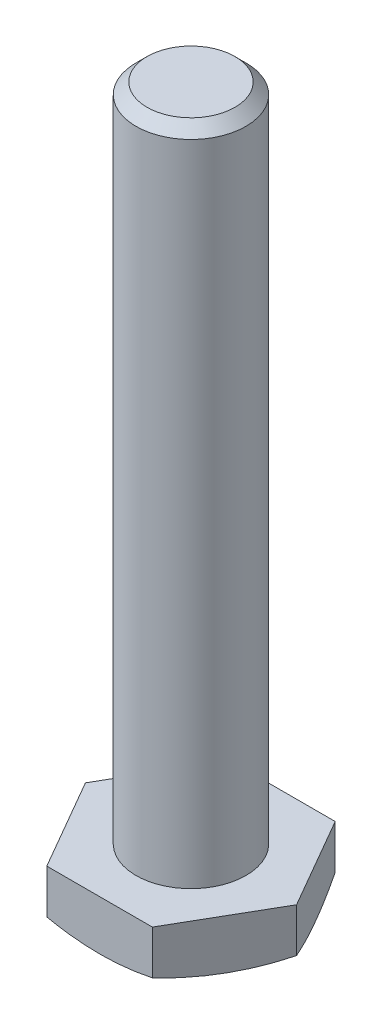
ISO-10303-21;
HEADER;
FILE_DESCRIPTION(('STEP AP214'),'2;1');
FILE_NAME('part.step','',(''),(''),'','','');
FILE_SCHEMA(('AUTOMOTIVE_DESIGN { 1 0 10303 214 1 1 1 1 }'));
ENDSEC;
DATA;
#1=APPLICATION_CONTEXT('core data for automotive mechanical design processes');
#2=APPLICATION_PROTOCOL_DEFINITION('international standard','automotive_design',2000,#1);
#3=PRODUCT_CONTEXT('',#1,'mechanical');
#4=PRODUCT('Part','Part','',(#3));
#5=PRODUCT_RELATED_PRODUCT_CATEGORY('part','',(#4));
#6=PRODUCT_DEFINITION_FORMATION('','',#4);
#7=PRODUCT_DEFINITION_CONTEXT('part definition',#1,'design');
#8=PRODUCT_DEFINITION('design','',#6,#7);
#9=PRODUCT_DEFINITION_SHAPE('','',#8);
#10=(LENGTH_UNIT() NAMED_UNIT(*) SI_UNIT(.MILLI.,.METRE.));
#11=(NAMED_UNIT(*) PLANE_ANGLE_UNIT() SI_UNIT($,.RADIAN.));
#12=(NAMED_UNIT(*) SI_UNIT($,.STERADIAN.) SOLID_ANGLE_UNIT());
#13=UNCERTAINTY_MEASURE_WITH_UNIT(LENGTH_MEASURE(1.E-05),#10,'distance_accuracy_value','');
#14=(GEOMETRIC_REPRESENTATION_CONTEXT(3) GLOBAL_UNCERTAINTY_ASSIGNED_CONTEXT((#13)) GLOBAL_UNIT_ASSIGNED_CONTEXT((#10,
#11,#12)) REPRESENTATION_CONTEXT('',''));
#15=CARTESIAN_POINT('',(0.,0.,0.));
#16=DIRECTION('',(0.,0.,1.));
#17=DIRECTION('',(1.,0.,0.));
#18=AXIS2_PLACEMENT_3D('',#15,#16,#17);
#19=CARTESIAN_POINT('',(0.,17.,0.));
#20=DIRECTION('',(0.,-1.,0.));
#21=DIRECTION('',(0.,0.,-1.));
#22=AXIS2_PLACEMENT_3D('',#19,#20,#21);
#23=PLANE('',#22);
#24=CARTESIAN_POINT('',(0.,17.,0.));
#25=DIRECTION('',(0.,1.,0.));
#26=DIRECTION('',(0.,0.,1.));
#27=AXIS2_PLACEMENT_3D('',#24,#25,#26);
#28=CIRCLE('',#27,2.5);
#29=CARTESIAN_POINT('',(0.,17.,2.5));
#30=VERTEX_POINT('',#29);
#31=EDGE_CURVE('E19',#30,#30,#28,.F.);
#32=ORIENTED_EDGE('',*,*,#31,.T.);
#33=EDGE_LOOP('',(#32));
#34=FACE_BOUND('',#33,.T.);
#35=ADVANCED_FACE('F16',(#34),#23,.T.);
#36=CARTESIAN_POINT('',(0.,0.,0.));
#37=DIRECTION('',(0.,1.,0.));
#38=DIRECTION('',(0.,0.,1.));
#39=AXIS2_PLACEMENT_3D('',#36,#37,#38);
#40=CYLINDRICAL_SURFACE('',#39,2.5);
#41=ORIENTED_EDGE('',*,*,#31,.F.);
#42=EDGE_LOOP('',(#41));
#43=FACE_BOUND('',#42,.T.);
#44=CARTESIAN_POINT('',(0.,0.130345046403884,0.));
#45=DIRECTION('',(0.,1.,0.));
#46=DIRECTION('',(0.,0.,1.));
#47=AXIS2_PLACEMENT_3D('',#44,#45,#46);
#48=CIRCLE('',#47,2.5);
#49=CARTESIAN_POINT('',(0.,0.130345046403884,2.5));
#50=VERTEX_POINT('',#49);
#51=EDGE_CURVE('E77',#50,#50,#48,.T.);
#52=ORIENTED_EDGE('',*,*,#51,.F.);
#53=EDGE_LOOP('',(#52));
#54=FACE_BOUND('',#53,.T.);
#55=ADVANCED_FACE('F105',(#43,#54),#40,.F.);
#56=CARTESIAN_POINT('',(0.,24.0399999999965,0.));
#57=DIRECTION('',(1.,0.,0.));
#58=DIRECTION('',(0.,1.,0.));
#59=AXIS2_PLACEMENT_3D('',#56,#57,#58);
#60=SPHERICAL_SURFACE('',#59,24.039999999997);
#61=CARTESIAN_POINT('',(-4.79999999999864,1.99999999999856,8.31384387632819));
#62=CARTESIAN_POINT('',(-4.95626736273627,1.93193499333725,8.04318086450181));
#63=CARTESIAN_POINT('',(-5.11323863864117,1.87052642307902,7.77129863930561));
#64=CARTESIAN_POINT('',(-5.42834591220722,1.76111116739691,7.2255168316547));
#65=CARTESIAN_POINT('',(-5.58648191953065,1.71310459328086,6.95161723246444));
#66=CARTESIAN_POINT('',(-6.06236395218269,1.58929807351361,6.12736537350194));
#67=CARTESIAN_POINT('',(-6.38148960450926,1.53375242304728,5.57462352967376));
#68=CARTESIAN_POINT('',(-7.01523246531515,1.47763040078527,4.4769486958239));
#69=CARTESIAN_POINT('',(-7.32982956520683,1.47609902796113,3.9320505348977));
#70=CARTESIAN_POINT('',(-7.95783469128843,1.52558457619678,2.84431374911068));
#71=CARTESIAN_POINT('',(-8.27124335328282,1.57656762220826,2.30147402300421));
#72=CARTESIAN_POINT('',(-8.75327508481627,1.69567560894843,1.46657057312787));
#73=CARTESIAN_POINT('',(-8.92307639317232,1.7455297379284,1.17246607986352));
#74=CARTESIAN_POINT('',(-9.2621964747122,1.86095859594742,0.585092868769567));
#75=CARTESIAN_POINT('',(-9.43150877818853,1.92660935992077,0.291835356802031));
#76=CARTESIAN_POINT('',(-9.59999999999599,1.99999999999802,2.16622028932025E-12));
#77=B_SPLINE_CURVE_WITH_KNOTS('',3,(#61,#62,#63,#64,#65,#66,#67,#68,#69,#70,#71,#72,#73,#74,#75,
#76),.UNSPECIFIED.,.F.,.F.,(4,2,2,2,2,2,2,4),(0.,0.959427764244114,1.91886349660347,
3.83831263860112,5.72380756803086,7.60808699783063,8.63749869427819,9.67196809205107),.UNSPECIFIED.);
#78=CARTESIAN_POINT('',(-4.79999999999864,1.99999999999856,8.31384387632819));
#79=VERTEX_POINT('',#78);
#80=CARTESIAN_POINT('',(-9.59999999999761,1.99999999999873,2.82207377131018E-12));
#81=VERTEX_POINT('',#80);
#82=EDGE_CURVE('E80',#79,#81,#77,.T.);
#83=ORIENTED_EDGE('',*,*,#82,.T.);
#84=CARTESIAN_POINT('',(-9.59999999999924,1.99999999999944,3.47814409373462E-12));
#85=CARTESIAN_POINT('',(-9.44373263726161,1.93193499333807,-0.270663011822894));
#86=CARTESIAN_POINT('',(-9.28676136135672,1.87052642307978,-0.542545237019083));
#87=CARTESIAN_POINT('',(-8.97165408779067,1.76111116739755,-1.08832704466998));
#88=CARTESIAN_POINT('',(-8.81351808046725,1.71310459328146,-1.36222664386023));
#89=CARTESIAN_POINT('',(-8.3376360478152,1.58929807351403,-2.18647850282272));
#90=CARTESIAN_POINT('',(-8.01851039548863,1.53375242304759,-2.7392203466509));
#91=CARTESIAN_POINT('',(-7.38476753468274,1.47763040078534,-3.83689518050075));
#92=CARTESIAN_POINT('',(-7.07017043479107,1.47609902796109,-4.38179334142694));
#93=CARTESIAN_POINT('',(-6.44216530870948,1.52558457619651,-5.46953012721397));
#94=CARTESIAN_POINT('',(-6.12875664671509,1.57656762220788,-6.01236985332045));
#95=CARTESIAN_POINT('',(-5.64672491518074,1.69567560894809,-6.84727330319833));
#96=CARTESIAN_POINT('',(-5.47692360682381,1.74552973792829,-7.14137779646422));
#97=CARTESIAN_POINT('',(-5.13780352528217,1.86095859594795,-7.72875100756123));
#98=CARTESIAN_POINT('',(-4.96849122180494,1.9266093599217,-8.02200851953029));
#99=CARTESIAN_POINT('',(-4.79999999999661,1.99999999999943,-8.31384387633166));
#100=B_SPLINE_CURVE_WITH_KNOTS('',3,(#84,#85,#86,#87,#88,#89,#90,#91,#92,#93,#94,#95,#96,#97,
#98,#99),.UNSPECIFIED.,.F.,.F.,(4,2,2,2,2,2,2,4),(0.,0.959427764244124,1.91886349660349,
3.83831263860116,5.72380756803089,7.60808699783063,8.63749869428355,9.67196809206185),.UNSPECIFIED.);
#101=CARTESIAN_POINT('',(-4.79999999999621,1.99999999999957,-8.31384387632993));
#102=VERTEX_POINT('',#101);
#103=EDGE_CURVE('E65',#81,#102,#100,.T.);
#104=ORIENTED_EDGE('',*,*,#103,.T.);
#105=CARTESIAN_POINT('',(-4.79999999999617,1.99999999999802,-8.31384387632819));
#106=CARTESIAN_POINT('',(-4.48746527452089,1.93193499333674,-8.31384387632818));
#107=CARTESIAN_POINT('',(-4.17352272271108,1.87052642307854,-8.31384387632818));
#108=CARTESIAN_POINT('',(-3.54330817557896,1.76111116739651,-8.31384387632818));
#109=CARTESIAN_POINT('',(-3.2270361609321,1.7131045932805,-8.31384387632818));
#110=CARTESIAN_POINT('',(-2.27527209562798,1.58929807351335,-8.31384387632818));
#111=CARTESIAN_POINT('',(-1.63702079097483,1.53375242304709,-8.31384387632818));
#112=CARTESIAN_POINT('',(-0.369535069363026,1.47763040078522,-8.31384387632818));
#113=CARTESIAN_POINT('',(0.259659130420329,1.47609902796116,-8.31384387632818));
#114=CARTESIAN_POINT('',(1.51566938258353,1.52558457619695,-8.31384387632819));
#115=CARTESIAN_POINT('',(2.14248670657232,1.57656762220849,-8.31384387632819));
#116=CARTESIAN_POINT('',(3.1065501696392,1.69567560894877,-8.31384387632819));
#117=CARTESIAN_POINT('',(3.44615278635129,1.74552973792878,-8.31384387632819));
#118=CARTESIAN_POINT('',(4.124392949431,1.86095859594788,-8.31384387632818));
#119=CARTESIAN_POINT('',(4.46301755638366,1.92660935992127,-8.31384387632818));
#120=CARTESIAN_POINT('',(4.79999999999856,1.99999999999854,-8.31384387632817));
#121=B_SPLINE_CURVE_WITH_KNOTS('',3,(#105,#106,#107,#108,#109,#110,#111,#112,#113,#114,#115,
#116,#117,#118,#119,#120),.UNSPECIFIED.,.F.,.F.,(4,2,2,2,2,2,2,4),(0.,0.95942776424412,
1.91886349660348,3.83831263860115,5.72380756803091,7.60808699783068,8.63749869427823,
9.67196809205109),.UNSPECIFIED.);
#122=CARTESIAN_POINT('',(4.79999999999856,1.99999999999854,-8.31384387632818));
#123=VERTEX_POINT('',#122);
#124=EDGE_CURVE('E116',#102,#123,#121,.T.);
#125=ORIENTED_EDGE('',*,*,#124,.T.);
#126=CARTESIAN_POINT('',(4.79999999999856,1.99999999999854,-8.31384387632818));
#127=CARTESIAN_POINT('',(4.9562673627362,1.93193499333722,-8.0431808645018));
#128=CARTESIAN_POINT('',(5.1132386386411,1.87052642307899,-7.77129863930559));
#129=CARTESIAN_POINT('',(5.42834591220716,1.76111116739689,-7.22551683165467));
#130=CARTESIAN_POINT('',(5.58648191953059,1.71310459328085,-6.95161723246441));
#131=CARTESIAN_POINT('',(6.06236395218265,1.5892980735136,-6.1273653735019));
#132=CARTESIAN_POINT('',(6.38148960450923,1.53375242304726,-5.57462352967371));
#133=CARTESIAN_POINT('',(7.01523246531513,1.47763040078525,-4.47694869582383));
#134=CARTESIAN_POINT('',(7.32982956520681,1.47609902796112,-3.93205053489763));
#135=CARTESIAN_POINT('',(7.95783469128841,1.52558457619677,-2.84431374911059));
#136=CARTESIAN_POINT('',(8.27124335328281,1.57656762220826,-2.30147402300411));
#137=CARTESIAN_POINT('',(8.75327508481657,1.6956756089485,-1.46657057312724));
#138=CARTESIAN_POINT('',(8.92307639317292,1.74552973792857,-1.17246607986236));
#139=CARTESIAN_POINT('',(9.2621964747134,1.86095859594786,-0.585092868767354));
#140=CARTESIAN_POINT('',(9.43150877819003,1.92660935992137,-0.291835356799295));
#141=CARTESIAN_POINT('',(9.59999999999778,1.99999999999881,1.0887030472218E-12));
#142=B_SPLINE_CURVE_WITH_KNOTS('',3,(#126,#127,#128,#129,#130,#131,#132,#133,#134,#135,#136,
#137,#138,#139,#140,#141),.UNSPECIFIED.,.F.,.F.,(4,2,2,2,2,2,2,4),(0.,0.959427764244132,
1.91886349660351,3.83831263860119,5.72380756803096,7.60808699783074,8.63749869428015,
9.6719680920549),.UNSPECIFIED.);
#143=CARTESIAN_POINT('',(9.59999999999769,1.99999999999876,1.78965722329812E-13));
#144=VERTEX_POINT('',#143);
#145=EDGE_CURVE('E124',#123,#144,#142,.T.);
#146=ORIENTED_EDGE('',*,*,#145,.T.);
#147=CARTESIAN_POINT('',(9.59999999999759,1.99999999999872,-7.30988442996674E-13));
#148=CARTESIAN_POINT('',(9.44373263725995,1.9319349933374,0.270663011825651));
#149=CARTESIAN_POINT('',(9.28676136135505,1.87052642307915,0.54254523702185));
#150=CARTESIAN_POINT('',(8.97165408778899,1.76111116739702,1.08832704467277));
#151=CARTESIAN_POINT('',(8.81351808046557,1.71310459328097,1.36222664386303));
#152=CARTESIAN_POINT('',(8.33763604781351,1.58929807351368,2.18647850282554));
#153=CARTESIAN_POINT('',(8.01851039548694,1.53375242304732,2.73922034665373));
#154=CARTESIAN_POINT('',(7.38476753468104,1.47763040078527,3.8368951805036));
#155=CARTESIAN_POINT('',(7.07017043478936,1.47609902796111,4.38179334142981));
#156=CARTESIAN_POINT('',(6.44216530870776,1.52558457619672,5.46953012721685));
#157=CARTESIAN_POINT('',(6.12875664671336,1.57656762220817,6.01236985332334));
#158=CARTESIAN_POINT('',(5.64672491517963,1.69567560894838,6.84727330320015));
#159=CARTESIAN_POINT('',(5.47692360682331,1.74552973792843,7.14137779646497));
#160=CARTESIAN_POINT('',(5.13780352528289,1.86095859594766,7.72875100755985));
#161=CARTESIAN_POINT('',(4.96849122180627,1.92660935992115,8.02200851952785));
#162=CARTESIAN_POINT('',(4.79999999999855,1.99999999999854,8.31384387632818));
#163=B_SPLINE_CURVE_WITH_KNOTS('',3,(#147,#148,#149,#150,#151,#152,#153,#154,#155,#156,#157,
#158,#159,#160,#161,#162),.UNSPECIFIED.,.F.,.F.,(4,2,2,2,2,2,2,4),(0.,0.959427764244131,
1.91886349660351,3.83831263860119,5.72380756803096,7.60808699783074,8.63749869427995,
9.67196809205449),.UNSPECIFIED.);
#164=CARTESIAN_POINT('',(4.79999999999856,1.99999999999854,8.31384387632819));
#165=VERTEX_POINT('',#164);
#166=EDGE_CURVE('E130',#144,#165,#163,.T.);
#167=ORIENTED_EDGE('',*,*,#166,.T.);
#168=CARTESIAN_POINT('',(4.79999999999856,1.99999999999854,8.31384387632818));
#169=CARTESIAN_POINT('',(4.48746527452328,1.93193499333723,8.31384387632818));
#170=CARTESIAN_POINT('',(4.17352272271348,1.87052642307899,8.31384387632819));
#171=CARTESIAN_POINT('',(3.54330817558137,1.76111116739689,8.31384387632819));
#172=CARTESIAN_POINT('',(3.22703616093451,1.71310459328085,8.31384387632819));
#173=CARTESIAN_POINT('',(2.2752720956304,1.5892980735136,8.31384387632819));
#174=CARTESIAN_POINT('',(1.63702079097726,1.53375242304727,8.31384387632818));
#175=CARTESIAN_POINT('',(0.369535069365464,1.47763040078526,8.31384387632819));
#176=CARTESIAN_POINT('',(-0.259659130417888,1.47609902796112,8.31384387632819));
#177=CARTESIAN_POINT('',(-1.51566938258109,1.52558457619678,8.31384387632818));
#178=CARTESIAN_POINT('',(-2.14248670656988,1.57656762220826,8.31384387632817));
#179=CARTESIAN_POINT('',(-3.10655016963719,1.69567560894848,8.31384387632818));
#180=CARTESIAN_POINT('',(-3.4461527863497,1.74552973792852,8.31384387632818));
#181=CARTESIAN_POINT('',(-4.12439294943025,1.86095859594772,8.31384387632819));
#182=CARTESIAN_POINT('',(-4.46301755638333,1.92660935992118,8.31384387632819));
#183=CARTESIAN_POINT('',(-4.79999999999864,1.99999999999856,8.31384387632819));
#184=B_SPLINE_CURVE_WITH_KNOTS('',3,(#168,#169,#170,#171,#172,#173,#174,#175,#176,#177,#178,
#179,#180,#181,#182,#183),.UNSPECIFIED.,.F.,.F.,(4,2,2,2,2,2,2,4),(0.,0.959427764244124,
1.91886349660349,3.83831263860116,5.72380756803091,7.60808699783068,8.63749869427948,
9.67196809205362),.UNSPECIFIED.);
#185=EDGE_CURVE('E84',#165,#79,#184,.T.);
#186=ORIENTED_EDGE('',*,*,#185,.T.);
#187=EDGE_LOOP('',(#83,#104,#125,#146,#167,#186));
#188=FACE_BOUND('',#187,.T.);
#189=ORIENTED_EDGE('',*,*,#51,.T.);
#190=EDGE_LOOP('',(#189));
#191=FACE_BOUND('',#190,.T.);
#192=ADVANCED_FACE('F81',(#188,#191),#60,.T.);
#193=CARTESIAN_POINT('',(-9.59999999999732,5.99999999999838,0.));
#194=DIRECTION('',(0.866025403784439,0.,0.5));
#195=DIRECTION('',(0.5,0.,-0.866025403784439));
#196=AXIS2_PLACEMENT_3D('',#193,#194,#195);
#197=PLANE('',#196);
#198=DIRECTION('',(0.,1.,0.));
#199=VECTOR('',#198,1.);
#200=CARTESIAN_POINT('',(-9.59999999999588,5.99999999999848,2.49453235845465E-12));
#201=LINE('',#200,#199);
#202=CARTESIAN_POINT('',(-9.59999999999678,5.99999999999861,1.14385917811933E-12));
#203=VERTEX_POINT('',#202);
#204=EDGE_CURVE('E70',#81,#203,#201,.T.);
#205=ORIENTED_EDGE('',*,*,#204,.T.);
#206=DIRECTION('',(-0.5,0.,0.866025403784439));
#207=VECTOR('',#206,1.);
#208=CARTESIAN_POINT('',(-4.79999999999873,5.99999999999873,-8.31384387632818));
#209=LINE('',#208,#207);
#210=CARTESIAN_POINT('',(-4.79999999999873,5.99999999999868,-8.31384387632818));
#211=VERTEX_POINT('',#210);
#212=EDGE_CURVE('E99',#211,#203,#209,.T.);
#213=ORIENTED_EDGE('',*,*,#212,.F.);
#214=DIRECTION('',(0.,1.,0.));
#215=VECTOR('',#214,1.);
#216=CARTESIAN_POINT('',(-4.79999999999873,5.99999999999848,-8.31384387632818));
#217=LINE('',#216,#215);
#218=EDGE_CURVE('E73',#211,#102,#217,.F.);
#219=ORIENTED_EDGE('',*,*,#218,.T.);
#220=ORIENTED_EDGE('',*,*,#103,.F.);
#221=EDGE_LOOP('',(#205,#213,#219,#220));
#222=FACE_BOUND('',#221,.T.);
#223=ADVANCED_FACE('F67',(#222),#197,.F.);
#224=CARTESIAN_POINT('',(-4.79999999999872,5.99999999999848,8.31384387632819));
#225=DIRECTION('',(0.866025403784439,0.,-0.5));
#226=DIRECTION('',(-0.5,0.,-0.866025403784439));
#227=AXIS2_PLACEMENT_3D('',#224,#225,#226);
#228=PLANE('',#227);
#229=DIRECTION('',(0.,1.,0.));
#230=VECTOR('',#229,1.);
#231=CARTESIAN_POINT('',(-4.79999999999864,5.99999999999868,8.31384387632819));
#232=LINE('',#231,#230);
#233=CARTESIAN_POINT('',(-4.79999999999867,5.9999999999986,8.31384387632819));
#234=VERTEX_POINT('',#233);
#235=EDGE_CURVE('E87',#79,#234,#232,.T.);
#236=ORIENTED_EDGE('',*,*,#235,.T.);
#237=DIRECTION('',(0.5,0.,0.866025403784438));
#238=VECTOR('',#237,1.);
#239=CARTESIAN_POINT('',(-9.59999999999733,5.99999999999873,0.));
#240=LINE('',#239,#238);
#241=EDGE_CURVE('E91',#203,#234,#240,.T.);
#242=ORIENTED_EDGE('',*,*,#241,.F.);
#243=ORIENTED_EDGE('',*,*,#204,.F.);
#244=ORIENTED_EDGE('',*,*,#82,.F.);
#245=EDGE_LOOP('',(#236,#242,#243,#244));
#246=FACE_BOUND('',#245,.T.);
#247=ADVANCED_FACE('F89',(#246),#228,.F.);
#248=CARTESIAN_POINT('',(4.79999999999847,5.99999999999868,8.31384387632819));
#249=DIRECTION('',(0.,0.,-1.));
#250=DIRECTION('',(-1.,0.,0.));
#251=AXIS2_PLACEMENT_3D('',#248,#249,#250);
#252=PLANE('',#251);
#253=DIRECTION('',(0.,1.,0.));
#254=VECTOR('',#253,1.);
#255=CARTESIAN_POINT('',(4.7999999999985,5.99999999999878,8.31384387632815));
#256=LINE('',#255,#254);
#257=CARTESIAN_POINT('',(4.79999999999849,5.9999999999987,8.31384387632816));
#258=VERTEX_POINT('',#257);
#259=EDGE_CURVE('E140',#165,#258,#256,.T.);
#260=ORIENTED_EDGE('',*,*,#259,.T.);
#261=DIRECTION('',(1.,0.,0.));
#262=VECTOR('',#261,1.);
#263=CARTESIAN_POINT('',(7.29999999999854,5.99999999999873,8.31384387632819));
#264=LINE('',#263,#262);
#265=EDGE_CURVE('E204',#234,#258,#264,.T.);
#266=ORIENTED_EDGE('',*,*,#265,.F.);
#267=ORIENTED_EDGE('',*,*,#235,.F.);
#268=ORIENTED_EDGE('',*,*,#185,.F.);
#269=EDGE_LOOP('',(#260,#266,#267,#268));
#270=FACE_BOUND('',#269,.T.);
#271=ADVANCED_FACE('F144',(#270),#252,.F.);
#272=CARTESIAN_POINT('',(9.59999999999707,5.99999999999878,0.));
#273=DIRECTION('',(-0.866025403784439,0.,-0.5));
#274=DIRECTION('',(-0.5,0.,0.866025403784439));
#275=AXIS2_PLACEMENT_3D('',#272,#273,#274);
#276=PLANE('',#275);
#277=DIRECTION('',(0.,1.,0.));
#278=VECTOR('',#277,1.);
#279=CARTESIAN_POINT('',(9.5999999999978,5.99999999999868,1.26808286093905E-12));
#280=LINE('',#279,#278);
#281=CARTESIAN_POINT('',(9.59999999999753,5.99999999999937,7.92496642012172E-13));
#282=VERTEX_POINT('',#281);
#283=EDGE_CURVE('E190',#144,#282,#280,.T.);
#284=ORIENTED_EDGE('',*,*,#283,.T.);
#285=DIRECTION('',(0.5,0.,-0.866025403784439));
#286=VECTOR('',#285,1.);
#287=CARTESIAN_POINT('',(4.79999999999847,5.99999999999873,8.31384387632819));
#288=LINE('',#287,#286);
#289=EDGE_CURVE('E193',#258,#282,#288,.T.);
#290=ORIENTED_EDGE('',*,*,#289,.F.);
#291=ORIENTED_EDGE('',*,*,#259,.F.);
#292=ORIENTED_EDGE('',*,*,#166,.F.);
#293=EDGE_LOOP('',(#284,#290,#291,#292));
#294=FACE_BOUND('',#293,.T.);
#295=ADVANCED_FACE('F147',(#294),#276,.F.);
#296=CARTESIAN_POINT('',(4.79999999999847,5.99999999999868,-8.31384387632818));
#297=DIRECTION('',(-0.866025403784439,0.,0.5));
#298=DIRECTION('',(0.5,0.,0.866025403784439));
#299=AXIS2_PLACEMENT_3D('',#296,#297,#298);
#300=PLANE('',#299);
#301=DIRECTION('',(0.,1.,0.));
#302=VECTOR('',#301,1.);
#303=CARTESIAN_POINT('',(4.79999999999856,5.99999999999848,-8.31384387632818));
#304=LINE('',#303,#302);
#305=CARTESIAN_POINT('',(4.79999999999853,5.9999999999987,-8.31384387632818));
#306=VERTEX_POINT('',#305);
#307=EDGE_CURVE('E34',#123,#306,#304,.T.);
#308=ORIENTED_EDGE('',*,*,#307,.T.);
#309=DIRECTION('',(-0.5,0.,-0.866025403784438));
#310=VECTOR('',#309,1.);
#311=CARTESIAN_POINT('',(9.59999999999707,5.99999999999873,0.));
#312=LINE('',#311,#310);
#313=EDGE_CURVE('E198',#282,#306,#312,.T.);
#314=ORIENTED_EDGE('',*,*,#313,.F.);
#315=ORIENTED_EDGE('',*,*,#283,.F.);
#316=ORIENTED_EDGE('',*,*,#145,.F.);
#317=EDGE_LOOP('',(#308,#314,#315,#316));
#318=FACE_BOUND('',#317,.T.);
#319=ADVANCED_FACE('F178',(#318),#300,.F.);
#320=CARTESIAN_POINT('',(-4.79999999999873,5.99999999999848,-8.31384387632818));
#321=DIRECTION('',(0.,0.,1.));
#322=DIRECTION('',(1.,0.,0.));
#323=AXIS2_PLACEMENT_3D('',#320,#321,#322);
#324=PLANE('',#323);
#325=ORIENTED_EDGE('',*,*,#218,.F.);
#326=DIRECTION('',(1.,0.,0.));
#327=VECTOR('',#326,1.);
#328=CARTESIAN_POINT('',(7.29999999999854,5.99999999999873,-8.31384387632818));
#329=LINE('',#328,#327);
#330=EDGE_CURVE('E201',#306,#211,#329,.F.);
#331=ORIENTED_EDGE('',*,*,#330,.F.);
#332=ORIENTED_EDGE('',*,*,#307,.F.);
#333=ORIENTED_EDGE('',*,*,#124,.F.);
#334=EDGE_LOOP('',(#325,#331,#332,#333));
#335=FACE_BOUND('',#334,.T.);
#336=ADVANCED_FACE('F174',(#335),#324,.F.);
#337=CARTESIAN_POINT('',(2.49999999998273,65.9999999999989,0.));
#338=DIRECTION('',(0.,1.,0.));
#339=DIRECTION('',(0.,0.,1.));
#340=AXIS2_PLACEMENT_3D('',#337,#338,#339);
#341=PLANE('',#340);
#342=CARTESIAN_POINT('',(-1.3830082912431E-12,66.0000000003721,0.));
#343=DIRECTION('',(0.,-1.,0.));
#344=DIRECTION('',(1.,0.,0.));
#345=AXIS2_PLACEMENT_3D('',#342,#343,#344);
#346=CIRCLE('',#345,4.00000000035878);
#347=CARTESIAN_POINT('',(4.00000000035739,66.0000000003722,0.));
#348=VERTEX_POINT('',#347);
#349=EDGE_CURVE('E210',#348,#348,#346,.T.);
#350=ORIENTED_EDGE('',*,*,#349,.F.);
#351=EDGE_LOOP('',(#350));
#352=FACE_BOUND('',#351,.T.);
#353=ADVANCED_FACE('F171',(#352),#341,.T.);
#354=CARTESIAN_POINT('',(7.29999999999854,5.99999999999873,0.));
#355=DIRECTION('',(0.,1.,0.));
#356=DIRECTION('',(0.,0.,1.));
#357=AXIS2_PLACEMENT_3D('',#354,#355,#356);
#358=PLANE('',#357);
#359=CARTESIAN_POINT('',(-1.25758099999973E-13,5.99999999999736,0.));
#360=DIRECTION('',(0.,-1.,0.));
#361=DIRECTION('',(1.,0.,0.));
#362=AXIS2_PLACEMENT_3D('',#359,#360,#361);
#363=CIRCLE('',#362,4.99999999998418);
#364=CARTESIAN_POINT('',(4.99999999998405,5.99999999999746,0.));
#365=VERTEX_POINT('',#364);
#366=EDGE_CURVE('E25',#365,#365,#363,.F.);
#367=ORIENTED_EDGE('',*,*,#366,.F.);
#368=EDGE_LOOP('',(#367));
#369=FACE_BOUND('',#368,.T.);
#370=ORIENTED_EDGE('',*,*,#313,.T.);
#371=ORIENTED_EDGE('',*,*,#330,.T.);
#372=ORIENTED_EDGE('',*,*,#212,.T.);
#373=ORIENTED_EDGE('',*,*,#241,.T.);
#374=ORIENTED_EDGE('',*,*,#265,.T.);
#375=ORIENTED_EDGE('',*,*,#289,.T.);
#376=EDGE_LOOP('',(#370,#371,#372,#373,#374,#375));
#377=FACE_BOUND('',#376,.T.);
#378=ADVANCED_FACE('F164',(#369,#377),#358,.T.);
#379=CARTESIAN_POINT('',(-1.36219160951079E-12,64.9999999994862,0.));
#380=DIRECTION('',(0.,-1.,0.));
#381=DIRECTION('',(1.,0.,0.));
#382=AXIS2_PLACEMENT_3D('',#379,#380,#381);
#383=CONICAL_SURFACE('',#382,4.9999999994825,0.7853981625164);
#384=CARTESIAN_POINT('',(-1.36237804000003E-12,64.9999999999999,0.));
#385=DIRECTION('',(0.,-1.,0.));
#386=DIRECTION('',(1.,0.,0.));
#387=AXIS2_PLACEMENT_3D('',#384,#385,#386);
#388=CIRCLE('',#387,4.99999999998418);
#389=CARTESIAN_POINT('',(4.99999999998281,65.,0.));
#390=VERTEX_POINT('',#389);
#391=EDGE_CURVE('E11',#390,#390,#388,.T.);
#392=ORIENTED_EDGE('',*,*,#391,.F.);
#393=EDGE_LOOP('',(#392));
#394=FACE_BOUND('',#393,.T.);
#395=ORIENTED_EDGE('',*,*,#349,.T.);
#396=EDGE_LOOP('',(#395));
#397=FACE_BOUND('',#396,.T.);
#398=ADVANCED_FACE('F158',(#394,#397),#383,.T.);
#399=CARTESIAN_POINT('',(-7.545479E-13,35.9999999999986,0.));
#400=DIRECTION('',(0.,-1.,0.));
#401=DIRECTION('',(1.,0.,0.));
#402=AXIS2_PLACEMENT_3D('',#399,#400,#401);
#403=CYLINDRICAL_SURFACE('',#402,4.99999999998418);
#404=ORIENTED_EDGE('',*,*,#391,.T.);
#405=EDGE_LOOP('',(#404));
#406=FACE_BOUND('',#405,.T.);
#407=ORIENTED_EDGE('',*,*,#366,.T.);
#408=EDGE_LOOP('',(#407));
#409=FACE_BOUND('',#408,.T.);
#410=ADVANCED_FACE('F156',(#406,#409),#403,.T.);
#411=CLOSED_SHELL('',(#35,#55,#192,#223,#247,#271,#295,#319,#336,#353,#378,#398,#410));
#412=MANIFOLD_SOLID_BREP('B1',#411);
#413=ADVANCED_BREP_SHAPE_REPRESENTATION('',(#18,#412),#14);
#414=SHAPE_DEFINITION_REPRESENTATION(#9,#413);
ENDSEC;
END-ISO-10303-21;
